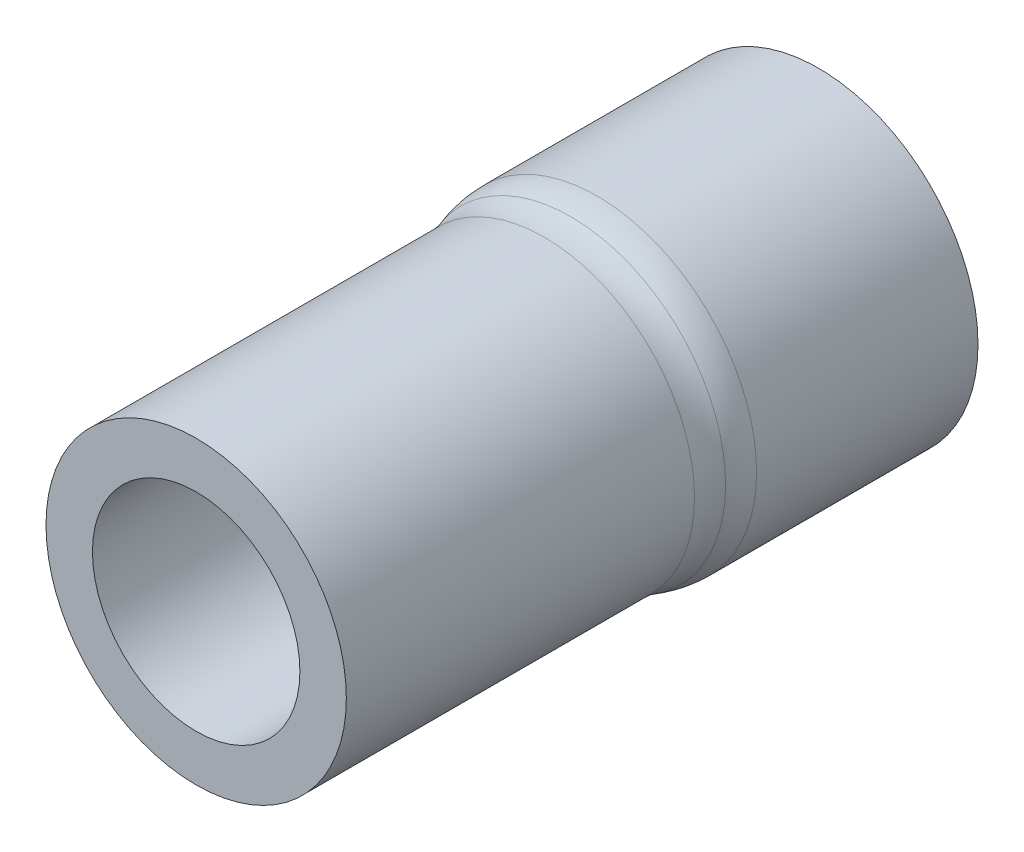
ISO-10303-21;
HEADER;
FILE_DESCRIPTION(('STEP AP214'),'2;1');
FILE_NAME('part.step','',(''),(''),'','','');
FILE_SCHEMA(('AUTOMOTIVE_DESIGN { 1 0 10303 214 1 1 1 1 }'));
ENDSEC;
DATA;
#1=APPLICATION_CONTEXT('core data for automotive mechanical design processes');
#2=APPLICATION_PROTOCOL_DEFINITION('international standard','automotive_design',2000,#1);
#3=PRODUCT_CONTEXT('',#1,'mechanical');
#4=PRODUCT('Part','Part','',(#3));
#5=PRODUCT_RELATED_PRODUCT_CATEGORY('part','',(#4));
#6=PRODUCT_DEFINITION_FORMATION('','',#4);
#7=PRODUCT_DEFINITION_CONTEXT('part definition',#1,'design');
#8=PRODUCT_DEFINITION('design','',#6,#7);
#9=PRODUCT_DEFINITION_SHAPE('','',#8);
#10=(LENGTH_UNIT() NAMED_UNIT(*) SI_UNIT(.MILLI.,.METRE.));
#11=(NAMED_UNIT(*) PLANE_ANGLE_UNIT() SI_UNIT($,.RADIAN.));
#12=(NAMED_UNIT(*) SI_UNIT($,.STERADIAN.) SOLID_ANGLE_UNIT());
#13=UNCERTAINTY_MEASURE_WITH_UNIT(LENGTH_MEASURE(1.E-05),#10,'distance_accuracy_value','');
#14=(GEOMETRIC_REPRESENTATION_CONTEXT(3) GLOBAL_UNCERTAINTY_ASSIGNED_CONTEXT((#13)) GLOBAL_UNIT_ASSIGNED_CONTEXT((#10,
#11,#12)) REPRESENTATION_CONTEXT('',''));
#15=CARTESIAN_POINT('',(0.,0.,0.));
#16=DIRECTION('',(0.,0.,1.));
#17=DIRECTION('',(1.,0.,0.));
#18=AXIS2_PLACEMENT_3D('',#15,#16,#17);
#19=CARTESIAN_POINT('',(-530.520213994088,-390.847059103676,-23.3453986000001));
#20=DIRECTION('',(0.,0.,1.));
#21=DIRECTION('',(1.,0.,0.));
#22=AXIS2_PLACEMENT_3D('',#19,#20,#21);
#23=CYLINDRICAL_SURFACE('',#22,2.4271478);
#24=CARTESIAN_POINT('',(-530.520213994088,-390.847059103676,-36.7113358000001));
#25=DIRECTION('',(0.,0.,1.));
#26=DIRECTION('',(1.,0.,0.));
#27=AXIS2_PLACEMENT_3D('',#24,#25,#26);
#28=CIRCLE('',#27,2.4271478);
#29=CARTESIAN_POINT('',(-528.093066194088,-390.847059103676,-36.7113358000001));
#30=VERTEX_POINT('',#29);
#31=EDGE_CURVE('E18',#30,#30,#28,.F.);
#32=ORIENTED_EDGE('',*,*,#31,.T.);
#33=EDGE_LOOP('',(#32));
#34=FACE_BOUND('',#33,.T.);
#35=CARTESIAN_POINT('',(-530.520213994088,-390.847059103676,-31.9567860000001));
#36=DIRECTION('',(0.,0.,1.));
#37=DIRECTION('',(1.,0.,0.));
#38=AXIS2_PLACEMENT_3D('',#35,#36,#37);
#39=CIRCLE('',#38,2.42714780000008);
#40=CARTESIAN_POINT('',(-528.093066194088,-390.847059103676,-31.9567860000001));
#41=VERTEX_POINT('',#40);
#42=EDGE_CURVE('E31',#41,#41,#39,.T.);
#43=ORIENTED_EDGE('',*,*,#42,.T.);
#44=EDGE_LOOP('',(#43));
#45=FACE_BOUND('',#44,.T.);
#46=ADVANCED_FACE('F15',(#34,#45),#23,.F.);
#47=CARTESIAN_POINT('',(-528.093066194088,-390.847059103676,-36.7113358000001));
#48=DIRECTION('',(0.,0.,1.));
#49=DIRECTION('',(1.,0.,0.));
#50=AXIS2_PLACEMENT_3D('',#47,#48,#49);
#51=PLANE('',#50);
#52=ORIENTED_EDGE('',*,*,#31,.F.);
#53=EDGE_LOOP('',(#52));
#54=FACE_BOUND('',#53,.T.);
#55=CARTESIAN_POINT('',(-530.520213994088,-390.847059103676,-36.7113358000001));
#56=DIRECTION('',(0.,0.,1.));
#57=DIRECTION('',(1.,0.,0.));
#58=AXIS2_PLACEMENT_3D('',#55,#56,#57);
#59=CIRCLE('',#58,3.4246058);
#60=CARTESIAN_POINT('',(-527.095608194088,-390.847059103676,-36.7113358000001));
#61=VERTEX_POINT('',#60);
#62=EDGE_CURVE('E35',#61,#61,#59,.T.);
#63=ORIENTED_EDGE('',*,*,#62,.F.);
#64=EDGE_LOOP('',(#63));
#65=FACE_BOUND('',#64,.T.);
#66=ADVANCED_FACE('F50',(#54,#65),#51,.F.);
#67=CARTESIAN_POINT('',(-530.520213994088,-390.847059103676,-31.9567860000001));
#68=DIRECTION('',(0.,0.,1.));
#69=DIRECTION('',(1.,0.,0.));
#70=AXIS2_PLACEMENT_3D('',#67,#68,#69);
#71=TOROIDAL_SURFACE('',#70,1.76217580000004,0.664972);
#72=ORIENTED_EDGE('',*,*,#42,.F.);
#73=EDGE_LOOP('',(#72));
#74=FACE_BOUND('',#73,.T.);
#75=CARTESIAN_POINT('',(-530.520213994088,-390.847059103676,-31.7299145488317));
#76=DIRECTION('',(0.,0.,1.));
#77=DIRECTION('',(1.,0.,0.));
#78=AXIS2_PLACEMENT_3D('',#75,#76,#77);
#79=CIRCLE('',#78,2.38724948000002);
#80=CARTESIAN_POINT('',(-528.132964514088,-390.847059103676,-31.7299145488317));
#81=VERTEX_POINT('',#80);
#82=EDGE_CURVE('E37',#81,#81,#79,.F.);
#83=ORIENTED_EDGE('',*,*,#82,.F.);
#84=EDGE_LOOP('',(#83));
#85=FACE_BOUND('',#84,.T.);
#86=ADVANCED_FACE('F53',(#74,#85),#71,.F.);
#87=CARTESIAN_POINT('',(-530.520213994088,-390.847059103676,-23.3453986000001));
#88=DIRECTION('',(0.,0.,1.));
#89=DIRECTION('',(1.,0.,0.));
#90=AXIS2_PLACEMENT_3D('',#87,#88,#89);
#91=CYLINDRICAL_SURFACE('',#90,3.4246058);
#92=CARTESIAN_POINT('',(-530.520213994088,-390.847059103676,-31.9567860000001));
#93=DIRECTION('',(0.,0.,1.));
#94=DIRECTION('',(1.,0.,0.));
#95=AXIS2_PLACEMENT_3D('',#92,#93,#94);
#96=CIRCLE('',#95,3.42460580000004);
#97=CARTESIAN_POINT('',(-527.095608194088,-390.847059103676,-31.9567860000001));
#98=VERTEX_POINT('',#97);
#99=EDGE_CURVE('E41',#98,#98,#96,.T.);
#100=ORIENTED_EDGE('',*,*,#99,.F.);
#101=EDGE_LOOP('',(#100));
#102=FACE_BOUND('',#101,.T.);
#103=ORIENTED_EDGE('',*,*,#62,.T.);
#104=EDGE_LOOP('',(#103));
#105=FACE_BOUND('',#104,.T.);
#106=ADVANCED_FACE('F59',(#102,#105),#91,.T.);
#107=CARTESIAN_POINT('',(-530.520213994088,-390.847059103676,-30.8224287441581));
#108=DIRECTION('',(0.,0.,1.));
#109=DIRECTION('',(1.,0.,0.));
#110=AXIS2_PLACEMENT_3D('',#107,#108,#109);
#111=TOROIDAL_SURFACE('',#110,4.88754420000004,2.659888);
#112=ORIENTED_EDGE('',*,*,#82,.T.);
#113=EDGE_LOOP('',(#112));
#114=FACE_BOUND('',#113,.T.);
#115=CARTESIAN_POINT('',(-530.520213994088,-390.847059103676,-30.8224287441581));
#116=DIRECTION('',(0.,0.,1.));
#117=DIRECTION('',(1.,0.,0.));
#118=AXIS2_PLACEMENT_3D('',#115,#116,#117);
#119=CIRCLE('',#118,2.2276562);
#120=CARTESIAN_POINT('',(-528.292557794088,-390.847059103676,-30.8224287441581));
#121=VERTEX_POINT('',#120);
#122=EDGE_CURVE('E84',#121,#121,#119,.T.);
#123=ORIENTED_EDGE('',*,*,#122,.T.);
#124=EDGE_LOOP('',(#123));
#125=FACE_BOUND('',#124,.T.);
#126=ADVANCED_FACE('F91',(#114,#125),#111,.T.);
#127=CARTESIAN_POINT('',(-530.520213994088,-390.847059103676,-31.9567860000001));
#128=DIRECTION('',(0.,0.,1.));
#129=DIRECTION('',(1.,0.,0.));
#130=AXIS2_PLACEMENT_3D('',#127,#128,#129);
#131=TOROIDAL_SURFACE('',#130,1.76217580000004,1.66243);
#132=CARTESIAN_POINT('',(-530.520213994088,-390.847059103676,-31.3896073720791));
#133=DIRECTION('',(0.,0.,1.));
#134=DIRECTION('',(1.,0.,0.));
#135=AXIS2_PLACEMENT_3D('',#132,#133,#134);
#136=CIRCLE('',#135,3.32485999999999);
#137=CARTESIAN_POINT('',(-527.195353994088,-390.847059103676,-31.3896073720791));
#138=VERTEX_POINT('',#137);
#139=EDGE_CURVE('E34',#138,#138,#136,.F.);
#140=ORIENTED_EDGE('',*,*,#139,.T.);
#141=EDGE_LOOP('',(#140));
#142=FACE_BOUND('',#141,.T.);
#143=ORIENTED_EDGE('',*,*,#99,.T.);
#144=EDGE_LOOP('',(#143));
#145=FACE_BOUND('',#144,.T.);
#146=ADVANCED_FACE('F88',(#142,#145),#131,.T.);
#147=CARTESIAN_POINT('',(-530.520213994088,-390.847059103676,-23.3453986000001));
#148=DIRECTION('',(0.,0.,1.));
#149=DIRECTION('',(1.,0.,0.));
#150=AXIS2_PLACEMENT_3D('',#147,#148,#149);
#151=CYLINDRICAL_SURFACE('',#150,2.2276562);
#152=ORIENTED_EDGE('',*,*,#122,.F.);
#153=EDGE_LOOP('',(#152));
#154=FACE_BOUND('',#153,.T.);
#155=CARTESIAN_POINT('',(-530.520213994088,-390.847059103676,-23.3453986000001));
#156=DIRECTION('',(0.,0.,1.));
#157=DIRECTION('',(1.,0.,0.));
#158=AXIS2_PLACEMENT_3D('',#155,#156,#157);
#159=CIRCLE('',#158,2.2276562);
#160=CARTESIAN_POINT('',(-528.292557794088,-390.847059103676,-23.3453986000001));
#161=VERTEX_POINT('',#160);
#162=EDGE_CURVE('E27',#161,#161,#159,.T.);
#163=ORIENTED_EDGE('',*,*,#162,.T.);
#164=EDGE_LOOP('',(#163));
#165=FACE_BOUND('',#164,.T.);
#166=ADVANCED_FACE('F77',(#154,#165),#151,.F.);
#167=CARTESIAN_POINT('',(-530.520213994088,-390.847059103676,-30.8224287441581));
#168=DIRECTION('',(0.,0.,1.));
#169=DIRECTION('',(1.,0.,0.));
#170=AXIS2_PLACEMENT_3D('',#167,#168,#169);
#171=TOROIDAL_SURFACE('',#170,4.88754420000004,1.66243);
#172=CARTESIAN_POINT('',(-530.520213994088,-390.847059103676,-30.8224287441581));
#173=DIRECTION('',(0.,0.,1.));
#174=DIRECTION('',(1.,0.,0.));
#175=AXIS2_PLACEMENT_3D('',#172,#173,#174);
#176=CIRCLE('',#175,3.2251142);
#177=CARTESIAN_POINT('',(-527.295099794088,-390.847059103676,-30.8224287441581));
#178=VERTEX_POINT('',#177);
#179=EDGE_CURVE('E22',#178,#178,#176,.T.);
#180=ORIENTED_EDGE('',*,*,#179,.F.);
#181=EDGE_LOOP('',(#180));
#182=FACE_BOUND('',#181,.T.);
#183=ORIENTED_EDGE('',*,*,#139,.F.);
#184=EDGE_LOOP('',(#183));
#185=FACE_BOUND('',#184,.T.);
#186=ADVANCED_FACE('F69',(#182,#185),#171,.F.);
#187=CARTESIAN_POINT('',(-527.295099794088,-390.847059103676,-23.3453986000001));
#188=DIRECTION('',(0.,0.,-1.));
#189=DIRECTION('',(-1.,0.,0.));
#190=AXIS2_PLACEMENT_3D('',#187,#188,#189);
#191=PLANE('',#190);
#192=ORIENTED_EDGE('',*,*,#162,.F.);
#193=EDGE_LOOP('',(#192));
#194=FACE_BOUND('',#193,.T.);
#195=CARTESIAN_POINT('',(-530.520213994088,-390.847059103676,-23.3453986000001));
#196=DIRECTION('',(0.,0.,1.));
#197=DIRECTION('',(1.,0.,0.));
#198=AXIS2_PLACEMENT_3D('',#195,#196,#197);
#199=CIRCLE('',#198,3.2251142);
#200=CARTESIAN_POINT('',(-527.295099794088,-390.847059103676,-23.3453986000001));
#201=VERTEX_POINT('',#200);
#202=EDGE_CURVE('E10',#201,#201,#199,.F.);
#203=ORIENTED_EDGE('',*,*,#202,.F.);
#204=EDGE_LOOP('',(#203));
#205=FACE_BOUND('',#204,.T.);
#206=ADVANCED_FACE('F64',(#194,#205),#191,.F.);
#207=CARTESIAN_POINT('',(-530.520213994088,-390.847059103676,-23.3453986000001));
#208=DIRECTION('',(0.,0.,1.));
#209=DIRECTION('',(1.,0.,0.));
#210=AXIS2_PLACEMENT_3D('',#207,#208,#209);
#211=CYLINDRICAL_SURFACE('',#210,3.2251142);
#212=ORIENTED_EDGE('',*,*,#202,.T.);
#213=EDGE_LOOP('',(#212));
#214=FACE_BOUND('',#213,.T.);
#215=ORIENTED_EDGE('',*,*,#179,.T.);
#216=EDGE_LOOP('',(#215));
#217=FACE_BOUND('',#216,.T.);
#218=ADVANCED_FACE('F62',(#214,#217),#211,.T.);
#219=CLOSED_SHELL('',(#46,#66,#86,#106,#126,#146,#166,#186,#206,#218));
#220=MANIFOLD_SOLID_BREP('B1',#219);
#221=ADVANCED_BREP_SHAPE_REPRESENTATION('',(#18,#220),#14);
#222=SHAPE_DEFINITION_REPRESENTATION(#9,#221);
ENDSEC;
END-ISO-10303-21;
